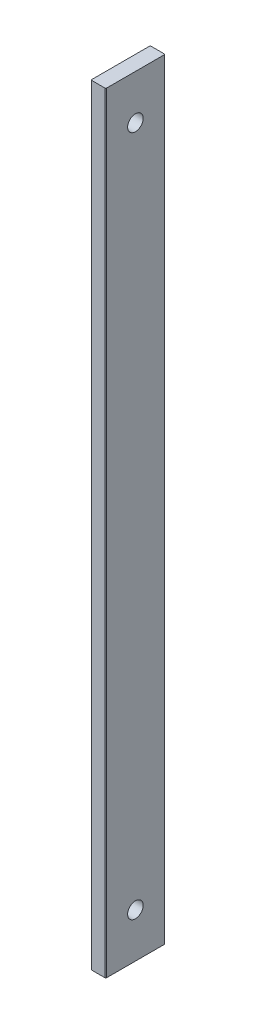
ISO-10303-21;
HEADER;
FILE_DESCRIPTION(('STEP AP214'),'2;1');
FILE_NAME('part.step','',(''),(''),'','','');
FILE_SCHEMA(('AUTOMOTIVE_DESIGN { 1 0 10303 214 1 1 1 1 }'));
ENDSEC;
DATA;
#1=APPLICATION_CONTEXT('core data for automotive mechanical design processes');
#2=APPLICATION_PROTOCOL_DEFINITION('international standard','automotive_design',2000,#1);
#3=PRODUCT_CONTEXT('',#1,'mechanical');
#4=PRODUCT('Part','Part','',(#3));
#5=PRODUCT_RELATED_PRODUCT_CATEGORY('part','',(#4));
#6=PRODUCT_DEFINITION_FORMATION('','',#4);
#7=PRODUCT_DEFINITION_CONTEXT('part definition',#1,'design');
#8=PRODUCT_DEFINITION('design','',#6,#7);
#9=PRODUCT_DEFINITION_SHAPE('','',#8);
#10=(LENGTH_UNIT() NAMED_UNIT(*) SI_UNIT(.MILLI.,.METRE.));
#11=(NAMED_UNIT(*) PLANE_ANGLE_UNIT() SI_UNIT($,.RADIAN.));
#12=(NAMED_UNIT(*) SI_UNIT($,.STERADIAN.) SOLID_ANGLE_UNIT());
#13=UNCERTAINTY_MEASURE_WITH_UNIT(LENGTH_MEASURE(1.E-05),#10,'distance_accuracy_value','');
#14=(GEOMETRIC_REPRESENTATION_CONTEXT(3) GLOBAL_UNCERTAINTY_ASSIGNED_CONTEXT((#13)) GLOBAL_UNIT_ASSIGNED_CONTEXT((#10,
#11,#12)) REPRESENTATION_CONTEXT('',''));
#15=CARTESIAN_POINT('',(0.,0.,0.));
#16=DIRECTION('',(0.,0.,1.));
#17=DIRECTION('',(1.,0.,0.));
#18=AXIS2_PLACEMENT_3D('',#15,#16,#17);
#19=CARTESIAN_POINT('',(5.,-260.,20.));
#20=DIRECTION('',(0.,0.,1.));
#21=DIRECTION('',(1.,0.,0.));
#22=AXIS2_PLACEMENT_3D('',#19,#20,#21);
#23=PLANE('',#22);
#24=DIRECTION('',(-1.,0.,0.));
#25=VECTOR('',#24,1.);
#26=CARTESIAN_POINT('',(5.,-260.,20.));
#27=LINE('',#26,#25);
#28=CARTESIAN_POINT('',(4.5,-260.,20.));
#29=VERTEX_POINT('',#28);
#30=CARTESIAN_POINT('',(-4.5,-260.,20.));
#31=VERTEX_POINT('',#30);
#32=EDGE_CURVE('E105',#29,#31,#27,.T.);
#33=ORIENTED_EDGE('',*,*,#32,.F.);
#34=DIRECTION('',(0.,1.,0.));
#35=VECTOR('',#34,1.);
#36=CARTESIAN_POINT('',(4.5,260.,20.));
#37=LINE('',#36,#35);
#38=CARTESIAN_POINT('',(4.5,260.,20.));
#39=VERTEX_POINT('',#38);
#40=EDGE_CURVE('E117',#29,#39,#37,.T.);
#41=ORIENTED_EDGE('',*,*,#40,.T.);
#42=DIRECTION('',(-1.,0.,0.));
#43=VECTOR('',#42,1.);
#44=CARTESIAN_POINT('',(5.,260.,20.));
#45=LINE('',#44,#43);
#46=CARTESIAN_POINT('',(-4.5,260.,20.));
#47=VERTEX_POINT('',#46);
#48=EDGE_CURVE('E169',#39,#47,#45,.T.);
#49=ORIENTED_EDGE('',*,*,#48,.T.);
#50=DIRECTION('',(0.,1.,0.));
#51=VECTOR('',#50,1.);
#52=CARTESIAN_POINT('',(-4.5,-260.,20.));
#53=LINE('',#52,#51);
#54=EDGE_CURVE('E120',#47,#31,#53,.F.);
#55=ORIENTED_EDGE('',*,*,#54,.T.);
#56=EDGE_LOOP('',(#33,#41,#49,#55));
#57=FACE_BOUND('',#56,.T.);
#58=ADVANCED_FACE('F35',(#57),#23,.T.);
#59=CARTESIAN_POINT('',(5.,-260.,-20.));
#60=DIRECTION('',(0.,-1.,0.));
#61=DIRECTION('',(0.,0.,-1.));
#62=AXIS2_PLACEMENT_3D('',#59,#60,#61);
#63=PLANE('',#62);
#64=DIRECTION('',(0.,0.,1.));
#65=VECTOR('',#64,1.);
#66=CARTESIAN_POINT('',(5.,-260.,-20.));
#67=LINE('',#66,#65);
#68=CARTESIAN_POINT('',(5.,-260.,-19.5));
#69=VERTEX_POINT('',#68);
#70=CARTESIAN_POINT('',(5.,-260.,19.5));
#71=VERTEX_POINT('',#70);
#72=EDGE_CURVE('E108',#69,#71,#67,.T.);
#73=ORIENTED_EDGE('',*,*,#72,.T.);
#74=CARTESIAN_POINT('',(4.5,-260.,19.5));
#75=DIRECTION('',(0.,-1.,0.));
#76=DIRECTION('',(0.,0.,-1.));
#77=AXIS2_PLACEMENT_3D('',#74,#75,#76);
#78=CIRCLE('',#77,0.5);
#79=EDGE_CURVE('E102',#71,#29,#78,.T.);
#80=ORIENTED_EDGE('',*,*,#79,.T.);
#81=ORIENTED_EDGE('',*,*,#32,.T.);
#82=CARTESIAN_POINT('',(-4.5,-260.,19.5));
#83=DIRECTION('',(0.,-1.,0.));
#84=DIRECTION('',(0.,0.,-1.));
#85=AXIS2_PLACEMENT_3D('',#82,#83,#84);
#86=CIRCLE('',#85,0.5);
#87=CARTESIAN_POINT('',(-5.,-260.,19.5));
#88=VERTEX_POINT('',#87);
#89=EDGE_CURVE('E141',#31,#88,#86,.T.);
#90=ORIENTED_EDGE('',*,*,#89,.T.);
#91=DIRECTION('',(0.,0.,1.));
#92=VECTOR('',#91,1.);
#93=CARTESIAN_POINT('',(-5.,-260.,-20.));
#94=LINE('',#93,#92);
#95=CARTESIAN_POINT('',(-5.,-260.,-19.5));
#96=VERTEX_POINT('',#95);
#97=EDGE_CURVE('E152',#96,#88,#94,.T.);
#98=ORIENTED_EDGE('',*,*,#97,.F.);
#99=CARTESIAN_POINT('',(-4.5,-260.,-19.5));
#100=DIRECTION('',(0.,-1.,0.));
#101=DIRECTION('',(0.,0.,-1.));
#102=AXIS2_PLACEMENT_3D('',#99,#100,#101);
#103=CIRCLE('',#102,0.5);
#104=CARTESIAN_POINT('',(-4.5,-260.,-20.));
#105=VERTEX_POINT('',#104);
#106=EDGE_CURVE('E50',#96,#105,#103,.T.);
#107=ORIENTED_EDGE('',*,*,#106,.T.);
#108=DIRECTION('',(-1.,0.,0.));
#109=VECTOR('',#108,1.);
#110=CARTESIAN_POINT('',(5.,-260.,-20.));
#111=LINE('',#110,#109);
#112=CARTESIAN_POINT('',(4.5,-260.,-20.));
#113=VERTEX_POINT('',#112);
#114=EDGE_CURVE('E121',#113,#105,#111,.T.);
#115=ORIENTED_EDGE('',*,*,#114,.F.);
#116=CARTESIAN_POINT('',(4.5,-260.,-19.5));
#117=DIRECTION('',(0.,-1.,0.));
#118=DIRECTION('',(0.,0.,-1.));
#119=AXIS2_PLACEMENT_3D('',#116,#117,#118);
#120=CIRCLE('',#119,0.5);
#121=EDGE_CURVE('E58',#113,#69,#120,.T.);
#122=ORIENTED_EDGE('',*,*,#121,.T.);
#123=EDGE_LOOP('',(#73,#80,#81,#90,#98,#107,#115,#122));
#124=FACE_BOUND('',#123,.T.);
#125=ADVANCED_FACE('F104',(#124),#63,.T.);
#126=CARTESIAN_POINT('',(5.,260.,-20.));
#127=DIRECTION('',(0.,0.,-1.));
#128=DIRECTION('',(-1.,0.,0.));
#129=AXIS2_PLACEMENT_3D('',#126,#127,#128);
#130=PLANE('',#129);
#131=DIRECTION('',(-1.,0.,0.));
#132=VECTOR('',#131,1.);
#133=CARTESIAN_POINT('',(5.,260.,-20.));
#134=LINE('',#133,#132);
#135=CARTESIAN_POINT('',(4.5,260.,-20.));
#136=VERTEX_POINT('',#135);
#137=CARTESIAN_POINT('',(-4.5,260.,-20.));
#138=VERTEX_POINT('',#137);
#139=EDGE_CURVE('E167',#136,#138,#134,.T.);
#140=ORIENTED_EDGE('',*,*,#139,.F.);
#141=DIRECTION('',(0.,-1.,0.));
#142=VECTOR('',#141,1.);
#143=CARTESIAN_POINT('',(4.5,-260.,-20.));
#144=LINE('',#143,#142);
#145=EDGE_CURVE('E145',#136,#113,#144,.T.);
#146=ORIENTED_EDGE('',*,*,#145,.T.);
#147=ORIENTED_EDGE('',*,*,#114,.T.);
#148=DIRECTION('',(0.,-1.,0.));
#149=VECTOR('',#148,1.);
#150=CARTESIAN_POINT('',(-4.5,260.,-20.));
#151=LINE('',#150,#149);
#152=EDGE_CURVE('E112',#105,#138,#151,.F.);
#153=ORIENTED_EDGE('',*,*,#152,.T.);
#154=EDGE_LOOP('',(#140,#146,#147,#153));
#155=FACE_BOUND('',#154,.T.);
#156=ADVANCED_FACE('F198',(#155),#130,.T.);
#157=CARTESIAN_POINT('',(5.,260.,20.));
#158=DIRECTION('',(0.,1.,0.));
#159=DIRECTION('',(0.,0.,1.));
#160=AXIS2_PLACEMENT_3D('',#157,#158,#159);
#161=PLANE('',#160);
#162=ORIENTED_EDGE('',*,*,#48,.F.);
#163=CARTESIAN_POINT('',(4.5,260.,19.5));
#164=DIRECTION('',(0.,1.,0.));
#165=DIRECTION('',(0.,0.,1.));
#166=AXIS2_PLACEMENT_3D('',#163,#164,#165);
#167=CIRCLE('',#166,0.5);
#168=CARTESIAN_POINT('',(5.,260.,19.5));
#169=VERTEX_POINT('',#168);
#170=EDGE_CURVE('E124',#39,#169,#167,.T.);
#171=ORIENTED_EDGE('',*,*,#170,.T.);
#172=DIRECTION('',(0.,0.,-1.));
#173=VECTOR('',#172,1.);
#174=CARTESIAN_POINT('',(5.,260.,20.));
#175=LINE('',#174,#173);
#176=CARTESIAN_POINT('',(5.,260.,-19.5));
#177=VERTEX_POINT('',#176);
#178=EDGE_CURVE('E158',#169,#177,#175,.T.);
#179=ORIENTED_EDGE('',*,*,#178,.T.);
#180=CARTESIAN_POINT('',(4.5,260.,-19.5));
#181=DIRECTION('',(0.,1.,0.));
#182=DIRECTION('',(0.,0.,1.));
#183=AXIS2_PLACEMENT_3D('',#180,#181,#182);
#184=CIRCLE('',#183,0.5);
#185=EDGE_CURVE('E133',#177,#136,#184,.T.);
#186=ORIENTED_EDGE('',*,*,#185,.T.);
#187=ORIENTED_EDGE('',*,*,#139,.T.);
#188=CARTESIAN_POINT('',(-4.5,260.,-19.5));
#189=DIRECTION('',(0.,1.,0.));
#190=DIRECTION('',(0.,0.,1.));
#191=AXIS2_PLACEMENT_3D('',#188,#189,#190);
#192=CIRCLE('',#191,0.5);
#193=CARTESIAN_POINT('',(-5.,260.,-19.5));
#194=VERTEX_POINT('',#193);
#195=EDGE_CURVE('E125',#138,#194,#192,.T.);
#196=ORIENTED_EDGE('',*,*,#195,.T.);
#197=DIRECTION('',(0.,0.,-1.));
#198=VECTOR('',#197,1.);
#199=CARTESIAN_POINT('',(-5.,260.,20.));
#200=LINE('',#199,#198);
#201=CARTESIAN_POINT('',(-5.,260.,19.5));
#202=VERTEX_POINT('',#201);
#203=EDGE_CURVE('E155',#202,#194,#200,.T.);
#204=ORIENTED_EDGE('',*,*,#203,.F.);
#205=CARTESIAN_POINT('',(-4.5,260.,19.5));
#206=DIRECTION('',(0.,1.,0.));
#207=DIRECTION('',(0.,0.,1.));
#208=AXIS2_PLACEMENT_3D('',#205,#206,#207);
#209=CIRCLE('',#208,0.5);
#210=EDGE_CURVE('E127',#202,#47,#209,.T.);
#211=ORIENTED_EDGE('',*,*,#210,.T.);
#212=EDGE_LOOP('',(#162,#171,#179,#186,#187,#196,#204,#211));
#213=FACE_BOUND('',#212,.T.);
#214=ADVANCED_FACE('F188',(#213),#161,.T.);
#215=CARTESIAN_POINT('',(5.,0.,0.));
#216=DIRECTION('',(-1.,0.,0.));
#217=DIRECTION('',(0.,0.,1.));
#218=AXIS2_PLACEMENT_3D('',#215,#216,#217);
#219=PLANE('',#218);
#220=CARTESIAN_POINT('',(5.,230.,0.));
#221=DIRECTION('',(1.,0.,0.));
#222=DIRECTION('',(0.,0.,-1.));
#223=AXIS2_PLACEMENT_3D('',#220,#221,#222);
#224=CIRCLE('',#223,5.24999999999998);
#225=CARTESIAN_POINT('',(5.,230.,-5.24999999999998));
#226=VERTEX_POINT('',#225);
#227=EDGE_CURVE('E179',#226,#226,#224,.T.);
#228=ORIENTED_EDGE('',*,*,#227,.F.);
#229=EDGE_LOOP('',(#228));
#230=FACE_BOUND('',#229,.T.);
#231=CARTESIAN_POINT('',(5.00000000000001,-230.,0.));
#232=DIRECTION('',(-1.,0.,0.));
#233=DIRECTION('',(0.,0.,1.));
#234=AXIS2_PLACEMENT_3D('',#231,#232,#233);
#235=CIRCLE('',#234,5.24999999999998);
#236=CARTESIAN_POINT('',(5.00000000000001,-230.,5.24999999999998));
#237=VERTEX_POINT('',#236);
#238=EDGE_CURVE('E162',#237,#237,#235,.T.);
#239=ORIENTED_EDGE('',*,*,#238,.T.);
#240=EDGE_LOOP('',(#239));
#241=FACE_BOUND('',#240,.T.);
#242=ORIENTED_EDGE('',*,*,#178,.F.);
#243=DIRECTION('',(0.,1.,0.));
#244=VECTOR('',#243,1.);
#245=CARTESIAN_POINT('',(5.,-260.,19.5));
#246=LINE('',#245,#244);
#247=EDGE_CURVE('E138',#169,#71,#246,.F.);
#248=ORIENTED_EDGE('',*,*,#247,.T.);
#249=ORIENTED_EDGE('',*,*,#72,.F.);
#250=DIRECTION('',(0.,-1.,0.));
#251=VECTOR('',#250,1.);
#252=CARTESIAN_POINT('',(5.,260.,-19.5));
#253=LINE('',#252,#251);
#254=EDGE_CURVE('E136',#69,#177,#253,.F.);
#255=ORIENTED_EDGE('',*,*,#254,.T.);
#256=EDGE_LOOP('',(#242,#248,#249,#255));
#257=FACE_BOUND('',#256,.T.);
#258=ADVANCED_FACE('F185',(#230,#241,#257),#219,.F.);
#259=CARTESIAN_POINT('',(-5.,0.,0.));
#260=DIRECTION('',(-1.,0.,0.));
#261=DIRECTION('',(0.,0.,1.));
#262=AXIS2_PLACEMENT_3D('',#259,#260,#261);
#263=PLANE('',#262);
#264=CARTESIAN_POINT('',(-5.00000000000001,230.,0.));
#265=DIRECTION('',(1.,0.,0.));
#266=DIRECTION('',(0.,0.,-1.));
#267=AXIS2_PLACEMENT_3D('',#264,#265,#266);
#268=CIRCLE('',#267,5.24999999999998);
#269=CARTESIAN_POINT('',(-5.00000000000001,230.,-5.24999999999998));
#270=VERTEX_POINT('',#269);
#271=EDGE_CURVE('E176',#270,#270,#268,.T.);
#272=ORIENTED_EDGE('',*,*,#271,.T.);
#273=EDGE_LOOP('',(#272));
#274=FACE_BOUND('',#273,.T.);
#275=CARTESIAN_POINT('',(-5.,-230.,0.));
#276=DIRECTION('',(-1.,0.,0.));
#277=DIRECTION('',(0.,0.,1.));
#278=AXIS2_PLACEMENT_3D('',#275,#276,#277);
#279=CIRCLE('',#278,5.24999999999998);
#280=CARTESIAN_POINT('',(-5.,-230.,5.24999999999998));
#281=VERTEX_POINT('',#280);
#282=EDGE_CURVE('E173',#281,#281,#279,.T.);
#283=ORIENTED_EDGE('',*,*,#282,.F.);
#284=EDGE_LOOP('',(#283));
#285=FACE_BOUND('',#284,.T.);
#286=ORIENTED_EDGE('',*,*,#97,.T.);
#287=DIRECTION('',(0.,1.,0.));
#288=VECTOR('',#287,1.);
#289=CARTESIAN_POINT('',(-5.,0.,19.5));
#290=LINE('',#289,#288);
#291=EDGE_CURVE('E11',#88,#202,#290,.T.);
#292=ORIENTED_EDGE('',*,*,#291,.T.);
#293=ORIENTED_EDGE('',*,*,#203,.T.);
#294=DIRECTION('',(0.,-1.,0.));
#295=VECTOR('',#294,1.);
#296=CARTESIAN_POINT('',(-5.,0.,-19.5));
#297=LINE('',#296,#295);
#298=EDGE_CURVE('E43',#194,#96,#297,.T.);
#299=ORIENTED_EDGE('',*,*,#298,.T.);
#300=EDGE_LOOP('',(#286,#292,#293,#299));
#301=FACE_BOUND('',#300,.T.);
#302=ADVANCED_FACE('F151',(#274,#285,#301),#263,.T.);
#303=CARTESIAN_POINT('',(-5.,-230.,0.));
#304=DIRECTION('',(-1.,0.,0.));
#305=DIRECTION('',(0.,0.,1.));
#306=AXIS2_PLACEMENT_3D('',#303,#304,#305);
#307=CYLINDRICAL_SURFACE('',#306,5.24999999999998);
#308=ORIENTED_EDGE('',*,*,#238,.F.);
#309=EDGE_LOOP('',(#308));
#310=FACE_BOUND('',#309,.T.);
#311=ORIENTED_EDGE('',*,*,#282,.T.);
#312=EDGE_LOOP('',(#311));
#313=FACE_BOUND('',#312,.T.);
#314=ADVANCED_FACE('F247',(#310,#313),#307,.F.);
#315=CARTESIAN_POINT('',(5.,230.,0.));
#316=DIRECTION('',(1.,0.,0.));
#317=DIRECTION('',(0.,0.,-1.));
#318=AXIS2_PLACEMENT_3D('',#315,#316,#317);
#319=CYLINDRICAL_SURFACE('',#318,5.24999999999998);
#320=ORIENTED_EDGE('',*,*,#271,.F.);
#321=EDGE_LOOP('',(#320));
#322=FACE_BOUND('',#321,.T.);
#323=ORIENTED_EDGE('',*,*,#227,.T.);
#324=EDGE_LOOP('',(#323));
#325=FACE_BOUND('',#324,.T.);
#326=ADVANCED_FACE('F183',(#322,#325),#319,.F.);
#327=CARTESIAN_POINT('',(4.5,-260.,19.5));
#328=DIRECTION('',(0.,-1.,0.));
#329=DIRECTION('',(0.,0.,-1.));
#330=AXIS2_PLACEMENT_3D('',#327,#328,#329);
#331=CYLINDRICAL_SURFACE('',#330,0.5);
#332=ORIENTED_EDGE('',*,*,#79,.F.);
#333=ORIENTED_EDGE('',*,*,#247,.F.);
#334=ORIENTED_EDGE('',*,*,#170,.F.);
#335=ORIENTED_EDGE('',*,*,#40,.F.);
#336=EDGE_LOOP('',(#332,#333,#334,#335));
#337=FACE_BOUND('',#336,.T.);
#338=ADVANCED_FACE('F123',(#337),#331,.T.);
#339=CARTESIAN_POINT('',(4.5,260.,-19.5));
#340=DIRECTION('',(0.,1.,0.));
#341=DIRECTION('',(0.,0.,1.));
#342=AXIS2_PLACEMENT_3D('',#339,#340,#341);
#343=CYLINDRICAL_SURFACE('',#342,0.5);
#344=ORIENTED_EDGE('',*,*,#185,.F.);
#345=ORIENTED_EDGE('',*,*,#254,.F.);
#346=ORIENTED_EDGE('',*,*,#121,.F.);
#347=ORIENTED_EDGE('',*,*,#145,.F.);
#348=EDGE_LOOP('',(#344,#345,#346,#347));
#349=FACE_BOUND('',#348,.T.);
#350=ADVANCED_FACE('F196',(#349),#343,.T.);
#351=CARTESIAN_POINT('',(-4.5,0.,19.5));
#352=DIRECTION('',(0.,1.,0.));
#353=DIRECTION('',(0.,0.,1.));
#354=AXIS2_PLACEMENT_3D('',#351,#352,#353);
#355=CYLINDRICAL_SURFACE('',#354,0.5);
#356=ORIENTED_EDGE('',*,*,#89,.F.);
#357=ORIENTED_EDGE('',*,*,#54,.F.);
#358=ORIENTED_EDGE('',*,*,#210,.F.);
#359=ORIENTED_EDGE('',*,*,#291,.F.);
#360=EDGE_LOOP('',(#356,#357,#358,#359));
#361=FACE_BOUND('',#360,.T.);
#362=ADVANCED_FACE('F201',(#361),#355,.T.);
#363=CARTESIAN_POINT('',(-4.5,0.,-19.5));
#364=DIRECTION('',(0.,-1.,0.));
#365=DIRECTION('',(0.,0.,-1.));
#366=AXIS2_PLACEMENT_3D('',#363,#364,#365);
#367=CYLINDRICAL_SURFACE('',#366,0.5);
#368=ORIENTED_EDGE('',*,*,#195,.F.);
#369=ORIENTED_EDGE('',*,*,#152,.F.);
#370=ORIENTED_EDGE('',*,*,#106,.F.);
#371=ORIENTED_EDGE('',*,*,#298,.F.);
#372=EDGE_LOOP('',(#368,#369,#370,#371));
#373=FACE_BOUND('',#372,.T.);
#374=ADVANCED_FACE('F37',(#373),#367,.T.);
#375=CLOSED_SHELL('',(#58,#125,#156,#214,#258,#302,#314,#326,#338,#350,#362,#374));
#376=MANIFOLD_SOLID_BREP('B2',#375);
#377=ADVANCED_BREP_SHAPE_REPRESENTATION('',(#18,#376),#14);
#378=SHAPE_DEFINITION_REPRESENTATION(#9,#377);
ENDSEC;
END-ISO-10303-21;
